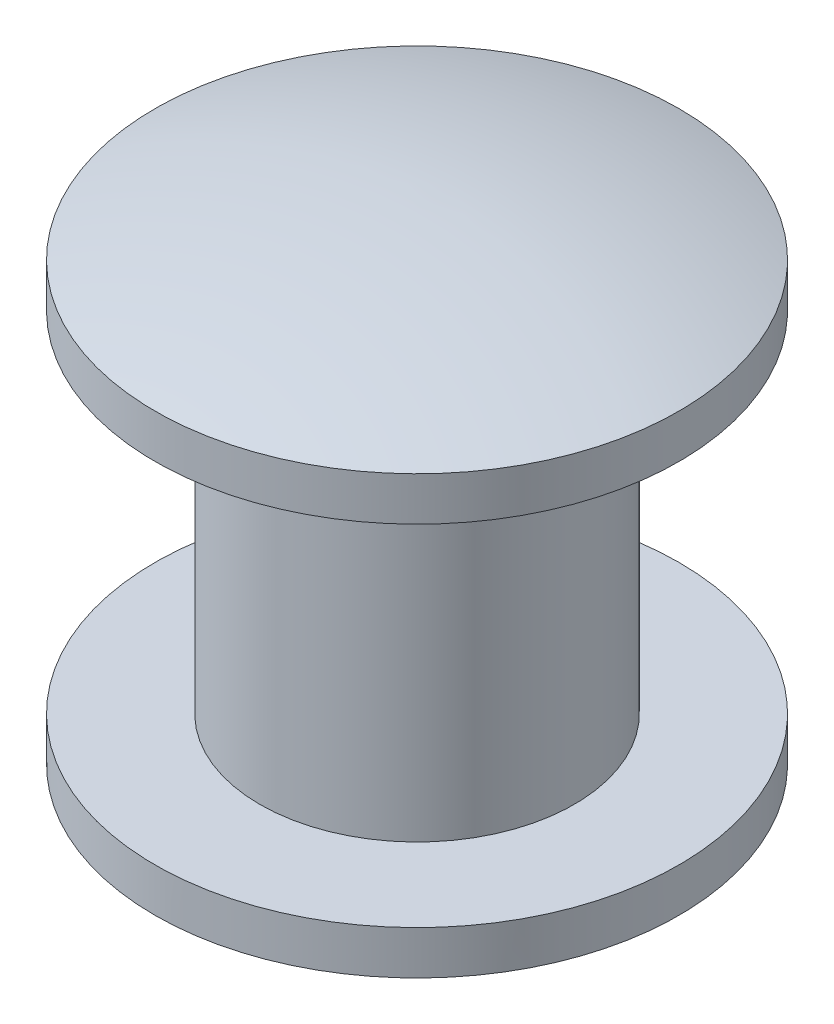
from build123d import *


with BuildPart() as part:
    # Sketch1 → Revolve1 (revolve)
    with BuildSketch(Plane(origin=(0, 0, 0), x_dir=(0, 0, -1), z_dir=(1, 0, 0))):
        with BuildLine():
            Line((3.81, -0.635), (3.81, -1.27))
            Line((3.81, -1.27), (2.286, -1.27))
            Line((2.286, -1.27), (2.286, -6.35))
            Line((2.286, -6.35), (3.81, -6.35))
            Line((3.81, -6.35), (3.81, -6.985))
            ThreePointArc((3.81, -6.985), (1.931277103, -7.46016262), (0, -7.62))
            Line((0, -7.62), (0, 0))
            ThreePointArc((0, 0), (1.931277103, -0.15983738), (3.81, -0.635))
        make_face()
    revolve(axis=Axis((0, -7.62, 0), (0, 1, 0)))


solid = part.part
